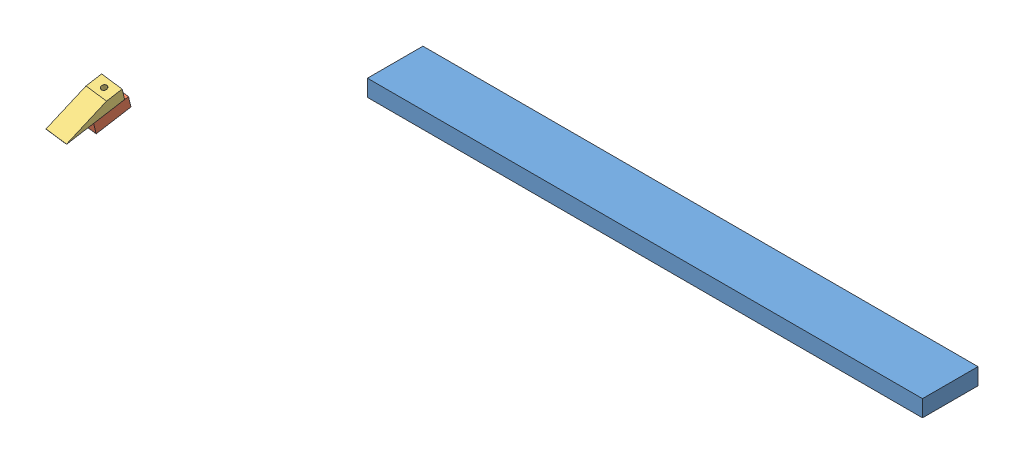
SolidWorks assembly messer-Balken-modul.SLDASM, configuration Standard (file format 3400). Lengths in mm.
Overall size (584.57 58.12 259.03).
3 component instances, 3 part files, 4 mates.
Components (placement in the parent):
- messer-balken-1: messer-balken.SLDPRT [Standard] at origin size (500 15 50)
- messer-halter-1: messer-halter.SLDPRT [Default] at (-82.9655 31.8692 179.8882) x (-0.085143 -0.261277 0.961502) z (-0.99566 0.058706 -0.072215) size (30 10 20)
- messer-2: messer.SLDPRT [Default] at (-70.3587 47.8964 157.5773) x (-0.085143 -0.261277 0.961502) z (-0.99566 0.058706 -0.072215) size (50 10 20)
Mates (geometry in assembly coordinates):
- Deckungsgleich1: coincident: point of messer-balken-1
- Konzentrisch11: concentric aligned: cylinder of messer-halter-1; cylinder of messer-2
- Deckungsgleich21: coincident anti-aligned: plane of messer-halter-1 through (-80.0354 49.3423 153.6946) normal (0.037578 0.963477 0.265141); plane of messer-2 through (-80.3153 48.4835 156.8551) normal (-0.037578 -0.963477 -0.265141)
- Parallel11: parallel aligned: plane of messer-halter-1 through (-60.1222 48.1682 155.1389) normal (0.085143 0.261277 -0.961502); plane of messer-2 through (-60.0263 56.9441 160.9508) normal (0.085143 0.261277 -0.961502)
